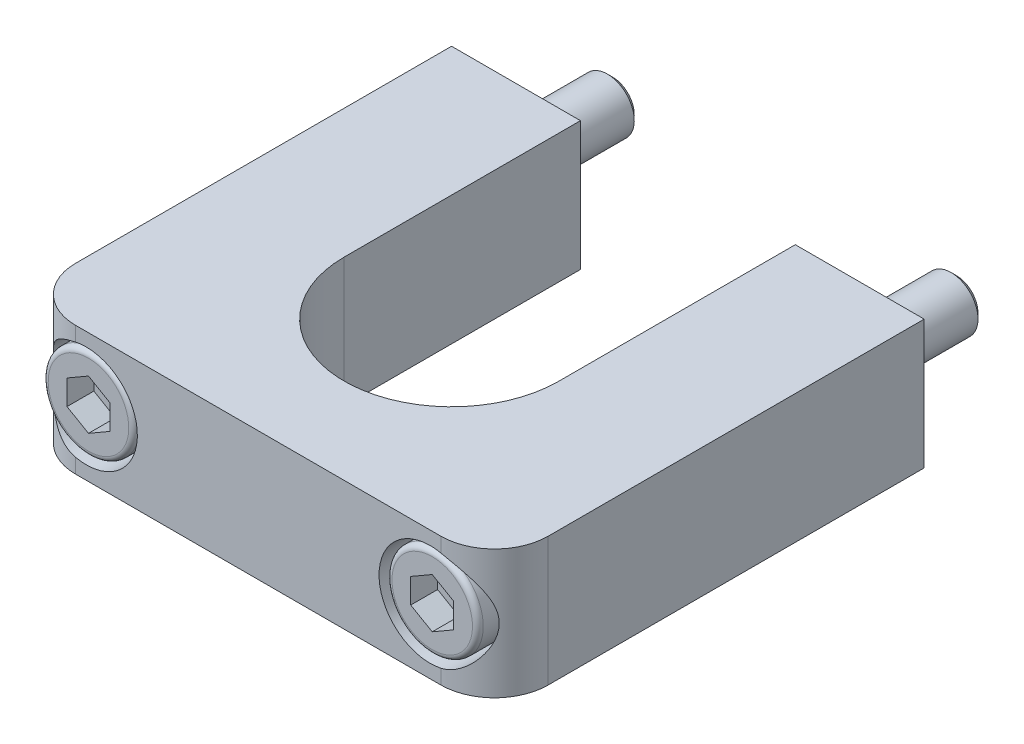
ISO-10303-21;
HEADER;
FILE_DESCRIPTION(('STEP AP214'),'2;1');
FILE_NAME('part.step','',(''),(''),'','','');
FILE_SCHEMA(('AUTOMOTIVE_DESIGN { 1 0 10303 214 1 1 1 1 }'));
ENDSEC;
DATA;
#1=APPLICATION_CONTEXT('core data for automotive mechanical design processes');
#2=APPLICATION_PROTOCOL_DEFINITION('international standard','automotive_design',2000,#1);
#3=PRODUCT_CONTEXT('',#1,'mechanical');
#4=PRODUCT('Part','Part','',(#3));
#5=PRODUCT_RELATED_PRODUCT_CATEGORY('part','',(#4));
#6=PRODUCT_DEFINITION_FORMATION('','',#4);
#7=PRODUCT_DEFINITION_CONTEXT('part definition',#1,'design');
#8=PRODUCT_DEFINITION('design','',#6,#7);
#9=PRODUCT_DEFINITION_SHAPE('','',#8);
#10=(LENGTH_UNIT() NAMED_UNIT(*) SI_UNIT(.MILLI.,.METRE.));
#11=(NAMED_UNIT(*) PLANE_ANGLE_UNIT() SI_UNIT($,.RADIAN.));
#12=(NAMED_UNIT(*) SI_UNIT($,.STERADIAN.) SOLID_ANGLE_UNIT());
#13=UNCERTAINTY_MEASURE_WITH_UNIT(LENGTH_MEASURE(1.E-05),#10,'distance_accuracy_value','');
#14=(GEOMETRIC_REPRESENTATION_CONTEXT(3) GLOBAL_UNCERTAINTY_ASSIGNED_CONTEXT((#13)) GLOBAL_UNIT_ASSIGNED_CONTEXT((#10,
#11,#12)) REPRESENTATION_CONTEXT('',''));
#15=CARTESIAN_POINT('',(0.,0.,0.));
#16=DIRECTION('',(0.,0.,1.));
#17=DIRECTION('',(1.,0.,0.));
#18=AXIS2_PLACEMENT_3D('',#15,#16,#17);
#19=CARTESIAN_POINT('',(32.,-1.38960957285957E-13,39.8));
#20=DIRECTION('',(0.,0.,-1.));
#21=DIRECTION('',(0.,1.,0.));
#22=AXIS2_PLACEMENT_3D('',#19,#20,#21);
#23=PLANE('',#22);
#24=CARTESIAN_POINT('',(32.,-1.38960957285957E-13,39.8));
#25=DIRECTION('',(0.,0.,-1.));
#26=DIRECTION('',(0.,1.,0.));
#27=AXIS2_PLACEMENT_3D('',#24,#25,#26);
#28=CIRCLE('',#27,3.75);
#29=CARTESIAN_POINT('',(32.,3.74999999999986,39.8));
#30=VERTEX_POINT('',#29);
#31=EDGE_CURVE('E256',#30,#30,#28,.T.);
#32=ORIENTED_EDGE('',*,*,#31,.F.);
#33=EDGE_LOOP('',(#32));
#34=FACE_BOUND('',#33,.T.);
#35=DIRECTION('',(0.,-1.,0.));
#36=VECTOR('',#35,1.);
#37=CARTESIAN_POINT('',(30.,-1.38960957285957E-13,39.8));
#38=LINE('',#37,#36);
#39=CARTESIAN_POINT('',(30.,1.15470053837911,39.8));
#40=VERTEX_POINT('',#39);
#41=CARTESIAN_POINT('',(30.,-1.15470053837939,39.8));
#42=VERTEX_POINT('',#41);
#43=EDGE_CURVE('E9',#40,#42,#38,.T.);
#44=ORIENTED_EDGE('',*,*,#43,.F.);
#45=DIRECTION('',(-0.866025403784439,-0.5,0.));
#46=VECTOR('',#45,1.);
#47=CARTESIAN_POINT('',(31.,1.73205080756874,39.8));
#48=LINE('',#47,#46);
#49=CARTESIAN_POINT('',(32.,2.30940107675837,39.8));
#50=VERTEX_POINT('',#49);
#51=EDGE_CURVE('E406',#50,#40,#48,.T.);
#52=ORIENTED_EDGE('',*,*,#51,.F.);
#53=DIRECTION('',(-0.866025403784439,0.5,0.));
#54=VECTOR('',#53,1.);
#55=CARTESIAN_POINT('',(33.,1.73205080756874,39.8));
#56=LINE('',#55,#54);
#57=CARTESIAN_POINT('',(34.,1.15470053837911,39.8));
#58=VERTEX_POINT('',#57);
#59=EDGE_CURVE('E408',#58,#50,#56,.T.);
#60=ORIENTED_EDGE('',*,*,#59,.F.);
#61=DIRECTION('',(0.,1.,0.));
#62=VECTOR('',#61,1.);
#63=CARTESIAN_POINT('',(34.,-1.38960957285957E-13,39.8));
#64=LINE('',#63,#62);
#65=CARTESIAN_POINT('',(34.,-1.15470053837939,39.8));
#66=VERTEX_POINT('',#65);
#67=EDGE_CURVE('E410',#66,#58,#64,.T.);
#68=ORIENTED_EDGE('',*,*,#67,.F.);
#69=DIRECTION('',(0.866025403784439,0.5,0.));
#70=VECTOR('',#69,1.);
#71=CARTESIAN_POINT('',(33.,-1.73205080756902,39.8));
#72=LINE('',#71,#70);
#73=CARTESIAN_POINT('',(32.,-2.30940107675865,39.8));
#74=VERTEX_POINT('',#73);
#75=EDGE_CURVE('E412',#74,#66,#72,.T.);
#76=ORIENTED_EDGE('',*,*,#75,.F.);
#77=DIRECTION('',(0.866025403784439,-0.5,0.));
#78=VECTOR('',#77,1.);
#79=CARTESIAN_POINT('',(31.,-1.73205080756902,39.8));
#80=LINE('',#79,#78);
#81=EDGE_CURVE('E23',#42,#74,#80,.T.);
#82=ORIENTED_EDGE('',*,*,#81,.F.);
#83=EDGE_LOOP('',(#44,#52,#60,#68,#76,#82));
#84=FACE_BOUND('',#83,.T.);
#85=ADVANCED_FACE('F14',(#34,#84),#23,.F.);
#86=CARTESIAN_POINT('',(0.,-1.38960957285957E-13,39.8));
#87=DIRECTION('',(0.,0.,-1.));
#88=DIRECTION('',(0.,1.,0.));
#89=AXIS2_PLACEMENT_3D('',#86,#87,#88);
#90=PLANE('',#89);
#91=CARTESIAN_POINT('',(0.,-1.38960957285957E-13,39.8));
#92=DIRECTION('',(0.,0.,-1.));
#93=DIRECTION('',(0.,1.,0.));
#94=AXIS2_PLACEMENT_3D('',#91,#92,#93);
#95=CIRCLE('',#94,3.75);
#96=CARTESIAN_POINT('',(0.,3.74999999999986,39.8));
#97=VERTEX_POINT('',#96);
#98=EDGE_CURVE('E265',#97,#97,#95,.T.);
#99=ORIENTED_EDGE('',*,*,#98,.F.);
#100=EDGE_LOOP('',(#99));
#101=FACE_BOUND('',#100,.T.);
#102=DIRECTION('',(0.,-1.,0.));
#103=VECTOR('',#102,1.);
#104=CARTESIAN_POINT('',(-2.,-1.38960957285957E-13,39.8));
#105=LINE('',#104,#103);
#106=CARTESIAN_POINT('',(-2.,1.15470053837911,39.8));
#107=VERTEX_POINT('',#106);
#108=CARTESIAN_POINT('',(-2.,-1.15470053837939,39.8));
#109=VERTEX_POINT('',#108);
#110=EDGE_CURVE('E404',#107,#109,#105,.T.);
#111=ORIENTED_EDGE('',*,*,#110,.F.);
#112=DIRECTION('',(-0.866025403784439,-0.5,0.));
#113=VECTOR('',#112,1.);
#114=CARTESIAN_POINT('',(-1.,1.73205080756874,39.8));
#115=LINE('',#114,#113);
#116=CARTESIAN_POINT('',(0.,2.30940107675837,39.8));
#117=VERTEX_POINT('',#116);
#118=EDGE_CURVE('E393',#117,#107,#115,.T.);
#119=ORIENTED_EDGE('',*,*,#118,.F.);
#120=DIRECTION('',(-0.866025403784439,0.5,0.));
#121=VECTOR('',#120,1.);
#122=CARTESIAN_POINT('',(1.,1.73205080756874,39.8));
#123=LINE('',#122,#121);
#124=CARTESIAN_POINT('',(2.,1.15470053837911,39.8));
#125=VERTEX_POINT('',#124);
#126=EDGE_CURVE('E395',#125,#117,#123,.T.);
#127=ORIENTED_EDGE('',*,*,#126,.F.);
#128=DIRECTION('',(0.,1.,0.));
#129=VECTOR('',#128,1.);
#130=CARTESIAN_POINT('',(2.,-1.38960957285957E-13,39.8));
#131=LINE('',#130,#129);
#132=CARTESIAN_POINT('',(2.,-1.15470053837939,39.8));
#133=VERTEX_POINT('',#132);
#134=EDGE_CURVE('E397',#133,#125,#131,.T.);
#135=ORIENTED_EDGE('',*,*,#134,.F.);
#136=DIRECTION('',(0.866025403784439,0.5,0.));
#137=VECTOR('',#136,1.);
#138=CARTESIAN_POINT('',(1.,-1.73205080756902,39.8));
#139=LINE('',#138,#137);
#140=CARTESIAN_POINT('',(0.,-2.30940107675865,39.8));
#141=VERTEX_POINT('',#140);
#142=EDGE_CURVE('E399',#141,#133,#139,.T.);
#143=ORIENTED_EDGE('',*,*,#142,.F.);
#144=DIRECTION('',(0.866025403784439,-0.5,0.));
#145=VECTOR('',#144,1.);
#146=CARTESIAN_POINT('',(-1.,-1.73205080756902,39.8));
#147=LINE('',#146,#145);
#148=EDGE_CURVE('E402',#109,#141,#147,.T.);
#149=ORIENTED_EDGE('',*,*,#148,.F.);
#150=EDGE_LOOP('',(#111,#119,#127,#135,#143,#149));
#151=FACE_BOUND('',#150,.T.);
#152=ADVANCED_FACE('F494',(#101,#151),#90,.F.);
#153=CARTESIAN_POINT('',(33.,-6.00000000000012,35.));
#154=DIRECTION('',(0.,1.,0.));
#155=DIRECTION('',(-1.,0.,0.));
#156=AXIS2_PLACEMENT_3D('',#153,#154,#155);
#157=CYLINDRICAL_SURFACE('',#156,5.);
#158=CARTESIAN_POINT('',(33.,-4.64354390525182,40.));
#159=CARTESIAN_POINT('',(33.113577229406,-4.61911352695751,40.000026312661));
#160=CARTESIAN_POINT('',(33.2261989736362,-4.5904727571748,39.996131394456));
#161=CARTESIAN_POINT('',(33.4484801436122,-4.52523301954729,39.9810830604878));
#162=CARTESIAN_POINT('',(33.5581428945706,-4.4886434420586,39.9699381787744));
#163=CARTESIAN_POINT('',(33.7727785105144,-4.40826406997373,39.9410985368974));
#164=CARTESIAN_POINT('',(33.8777841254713,-4.36454038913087,39.9234622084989));
#165=CARTESIAN_POINT('',(34.0834508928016,-4.27019279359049,39.8823298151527));
#166=CARTESIAN_POINT('',(34.1841109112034,-4.21956709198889,39.8588322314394));
#167=CARTESIAN_POINT('',(34.4778166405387,-4.05863601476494,39.7808868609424));
#168=CARTESIAN_POINT('',(34.6637550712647,-3.93883272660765,39.7188155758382));
#169=CARTESIAN_POINT('',(35.0141615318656,-3.67767986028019,39.5802666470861));
#170=CARTESIAN_POINT('',(35.1785767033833,-3.5362790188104,39.5037546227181));
#171=CARTESIAN_POINT('',(35.5055631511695,-3.21450833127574,39.3313669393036));
#172=CARTESIAN_POINT('',(35.6648440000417,-3.03145406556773,39.2342729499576));
#173=CARTESIAN_POINT('',(35.9535549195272,-2.6439312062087,39.0381869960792));
#174=CARTESIAN_POINT('',(36.0829676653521,-2.43945028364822,38.9391939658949));
#175=CARTESIAN_POINT('',(36.3004062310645,-2.02927596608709,38.7583847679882));
#176=CARTESIAN_POINT('',(36.391102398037,-1.82533494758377,38.6758243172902));
#177=CARTESIAN_POINT('',(36.5442204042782,-1.40111936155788,38.528431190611));
#178=CARTESIAN_POINT('',(36.606705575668,-1.1808826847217,38.4635589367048));
#179=CARTESIAN_POINT('',(36.6893902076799,-0.777505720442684,38.3750946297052));
#180=CARTESIAN_POINT('',(36.7159053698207,-0.597016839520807,38.3455288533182));
#181=CARTESIAN_POINT('',(36.7478525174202,-0.232010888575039,38.3097185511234));
#182=CARTESIAN_POINT('',(36.7533170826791,-0.0475004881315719,38.3034379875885));
#183=CARTESIAN_POINT('',(36.7427725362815,0.320047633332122,38.3153716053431));
#184=CARTESIAN_POINT('',(36.7267645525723,0.503085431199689,38.3335844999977));
#185=CARTESIAN_POINT('',(36.6745073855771,0.862962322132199,38.3910845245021));
#186=CARTESIAN_POINT('',(36.6382176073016,1.03978822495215,38.4304139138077));
#187=CARTESIAN_POINT('',(36.5280009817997,1.4574449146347,38.544254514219));
#188=CARTESIAN_POINT('',(36.4446409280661,1.69363572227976,38.626612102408));
#189=CARTESIAN_POINT('',(36.295087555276,2.03224760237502,38.7612447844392));
#190=CARTESIAN_POINT('',(36.2410521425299,2.14265838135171,38.8080496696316));
#191=CARTESIAN_POINT('',(36.1250506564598,2.35826640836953,38.9038071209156));
#192=CARTESIAN_POINT('',(36.0630855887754,2.46346431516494,38.9527594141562));
#193=CARTESIAN_POINT('',(35.8607080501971,2.77873907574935,39.1043117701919));
#194=CARTESIAN_POINT('',(35.7074779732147,2.98020199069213,39.2081022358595));
#195=CARTESIAN_POINT('',(35.3688464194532,3.35822314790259,39.4076351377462));
#196=CARTESIAN_POINT('',(35.1834791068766,3.53480748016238,39.5033859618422));
#197=CARTESIAN_POINT('',(34.8096663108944,3.83632408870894,39.6648073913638));
#198=CARTESIAN_POINT('',(34.6253318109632,3.96502834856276,39.7328152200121));
#199=CARTESIAN_POINT('',(34.3334066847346,4.13890556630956,39.8199942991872));
#200=CARTESIAN_POINT('',(34.2336119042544,4.19363274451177,39.8465668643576));
#201=CARTESIAN_POINT('',(34.0292831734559,4.29622741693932,39.8940340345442));
#202=CARTESIAN_POINT('',(33.9247508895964,4.34409729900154,39.9149306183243));
#203=CARTESIAN_POINT('',(33.6871516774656,4.44253129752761,39.9543331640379));
#204=CARTESIAN_POINT('',(33.5530154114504,4.49121867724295,39.9712061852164));
#205=CARTESIAN_POINT('',(33.3481874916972,4.5552211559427,39.9883353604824));
#206=CARTESIAN_POINT('',(33.2792063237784,4.57507245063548,39.9926820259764));
#207=CARTESIAN_POINT('',(33.1402725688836,4.6116637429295,39.9985159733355));
#208=CARTESIAN_POINT('',(33.0703195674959,4.62840236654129,40.0000019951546));
#209=CARTESIAN_POINT('',(33.,4.64354390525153,40.));
#210=B_SPLINE_CURVE_WITH_KNOTS('',3,(#158,#159,#160,#161,#162,#163,#164,#165,#166,#167,#168,
#169,#170,#171,#172,#173,#174,#175,#176,#177,#178,#179,#180,#181,#182,#183,#184,#185,#186,#187,
#188,#189,#190,#191,#192,#193,#194,#195,#196,#197,#198,#199,#200,#201,#202,#203,#204,#205,#206,
#207,#208,#209),.UNSPECIFIED.,.F.,.F.,(4,2,2,2,2,2,2,2,2,2,2,2,2,2,2,2,2,2,2,2,2,2,2,2,2,4),(0.,
0.348307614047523,0.69620596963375,1.04104644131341,1.38597636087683,2.07210353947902,
2.75988535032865,3.54118531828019,4.32293734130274,5.03460033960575,5.74465765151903,
6.29670085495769,6.84788932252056,7.39904883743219,7.95131549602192,8.73767249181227,
9.13202620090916,9.52632994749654,10.3438248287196,11.1604559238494,11.8620649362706,
12.2123213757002,12.5624555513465,12.9924670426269,13.2080905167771,13.4238089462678),.UNSPECIFIED.);
#211=CARTESIAN_POINT('',(33.,-4.64354390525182,40.));
#212=VERTEX_POINT('',#211);
#213=CARTESIAN_POINT('',(33.,4.64354390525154,40.));
#214=VERTEX_POINT('',#213);
#215=EDGE_CURVE('E271',#212,#214,#210,.T.);
#216=ORIENTED_EDGE('',*,*,#215,.F.);
#217=DIRECTION('',(0.,1.,0.));
#218=VECTOR('',#217,1.);
#219=CARTESIAN_POINT('',(33.,-6.00000000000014,40.));
#220=LINE('',#219,#218);
#221=CARTESIAN_POINT('',(33.,-6.00000000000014,40.));
#222=VERTEX_POINT('',#221);
#223=EDGE_CURVE('E363',#222,#212,#220,.T.);
#224=ORIENTED_EDGE('',*,*,#223,.F.);
#225=CARTESIAN_POINT('',(33.,-6.00000000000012,35.));
#226=DIRECTION('',(0.,-1.,0.));
#227=DIRECTION('',(1.,0.,0.));
#228=AXIS2_PLACEMENT_3D('',#225,#226,#227);
#229=CIRCLE('',#228,5.);
#230=CARTESIAN_POINT('',(38.,-6.00000000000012,35.));
#231=VERTEX_POINT('',#230);
#232=EDGE_CURVE('E332',#231,#222,#229,.T.);
#233=ORIENTED_EDGE('',*,*,#232,.F.);
#234=DIRECTION('',(0.,1.,0.));
#235=VECTOR('',#234,1.);
#236=CARTESIAN_POINT('',(38.,-6.00000000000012,35.));
#237=LINE('',#236,#235);
#238=CARTESIAN_POINT('',(38.,5.99999999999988,35.));
#239=VERTEX_POINT('',#238);
#240=EDGE_CURVE('E366',#231,#239,#237,.T.);
#241=ORIENTED_EDGE('',*,*,#240,.T.);
#242=CARTESIAN_POINT('',(33.,5.99999999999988,35.));
#243=DIRECTION('',(0.,-1.,0.));
#244=DIRECTION('',(1.,0.,0.));
#245=AXIS2_PLACEMENT_3D('',#242,#243,#244);
#246=CIRCLE('',#245,5.);
#247=CARTESIAN_POINT('',(33.,5.99999999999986,40.));
#248=VERTEX_POINT('',#247);
#249=EDGE_CURVE('E354',#239,#248,#246,.T.);
#250=ORIENTED_EDGE('',*,*,#249,.T.);
#251=EDGE_CURVE('E362',#214,#248,#220,.T.);
#252=ORIENTED_EDGE('',*,*,#251,.F.);
#253=EDGE_LOOP('',(#216,#224,#233,#241,#250,#252));
#254=FACE_BOUND('',#253,.T.);
#255=ADVANCED_FACE('F281',(#254),#157,.T.);
#256=CARTESIAN_POINT('',(-1.,-6.00000000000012,35.));
#257=DIRECTION('',(0.,1.,0.));
#258=DIRECTION('',(-1.,0.,0.));
#259=AXIS2_PLACEMENT_3D('',#256,#257,#258);
#260=CYLINDRICAL_SURFACE('',#259,5.);
#261=CARTESIAN_POINT('',(-1.,4.64354390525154,40.));
#262=CARTESIAN_POINT('',(-1.11357722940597,4.61911352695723,40.000026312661));
#263=CARTESIAN_POINT('',(-1.22619897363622,4.59047275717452,39.9961313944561));
#264=CARTESIAN_POINT('',(-1.44848014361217,4.52523301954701,39.9810830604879));
#265=CARTESIAN_POINT('',(-1.55814289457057,4.48864344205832,39.9699381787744));
#266=CARTESIAN_POINT('',(-1.77277851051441,4.40826406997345,39.9410985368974));
#267=CARTESIAN_POINT('',(-1.87778412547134,4.36454038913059,39.9234622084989));
#268=CARTESIAN_POINT('',(-2.08345089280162,4.27019279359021,39.8823298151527));
#269=CARTESIAN_POINT('',(-2.18411091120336,4.21956709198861,39.8588322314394));
#270=CARTESIAN_POINT('',(-2.47781664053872,4.05863601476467,39.7808868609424));
#271=CARTESIAN_POINT('',(-2.66375507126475,3.93883272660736,39.7188155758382));
#272=CARTESIAN_POINT('',(-3.01416153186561,3.67767986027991,39.5802666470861));
#273=CARTESIAN_POINT('',(-3.17857670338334,3.53627901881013,39.5037546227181));
#274=CARTESIAN_POINT('',(-3.50556315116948,3.21450833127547,39.3313669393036));
#275=CARTESIAN_POINT('',(-3.66484400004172,3.03145406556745,39.2342729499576));
#276=CARTESIAN_POINT('',(-3.9535549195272,2.64393120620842,39.0381869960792));
#277=CARTESIAN_POINT('',(-4.08296766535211,2.43945028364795,38.9391939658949));
#278=CARTESIAN_POINT('',(-4.30040623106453,2.02927596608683,38.7583847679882));
#279=CARTESIAN_POINT('',(-4.39110239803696,1.82533494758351,38.6758243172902));
#280=CARTESIAN_POINT('',(-4.54422040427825,1.40111936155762,38.528431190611));
#281=CARTESIAN_POINT('',(-4.60670557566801,1.18088268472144,38.4635589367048));
#282=CARTESIAN_POINT('',(-4.68939020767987,0.777505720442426,38.3750946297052));
#283=CARTESIAN_POINT('',(-4.71590536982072,0.597016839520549,38.3455288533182));
#284=CARTESIAN_POINT('',(-4.74785251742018,0.23201088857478,38.3097185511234));
#285=CARTESIAN_POINT('',(-4.75331708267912,0.0475004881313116,38.3034379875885));
#286=CARTESIAN_POINT('',(-4.74277253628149,-0.320047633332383,38.3153716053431));
#287=CARTESIAN_POINT('',(-4.72676455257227,-0.503085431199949,38.3335844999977));
#288=CARTESIAN_POINT('',(-4.67450738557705,-0.862962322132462,38.3910845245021));
#289=CARTESIAN_POINT('',(-4.63821760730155,-1.03978822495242,38.4304139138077));
#290=CARTESIAN_POINT('',(-4.52800098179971,-1.45744491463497,38.5442545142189));
#291=CARTESIAN_POINT('',(-4.44464092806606,-1.69363572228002,38.626612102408));
#292=CARTESIAN_POINT('',(-4.29508755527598,-2.03224760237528,38.7612447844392));
#293=CARTESIAN_POINT('',(-4.24105214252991,-2.14265838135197,38.8080496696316));
#294=CARTESIAN_POINT('',(-4.1250506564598,-2.3582664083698,38.9038071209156));
#295=CARTESIAN_POINT('',(-4.06308558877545,-2.46346431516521,38.9527594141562));
#296=CARTESIAN_POINT('',(-3.86070805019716,-2.77873907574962,39.1043117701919));
#297=CARTESIAN_POINT('',(-3.7074779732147,-2.9802019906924,39.2081022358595));
#298=CARTESIAN_POINT('',(-3.36884641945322,-3.35822314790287,39.4076351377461));
#299=CARTESIAN_POINT('',(-3.18347910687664,-3.53480748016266,39.5033859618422));
#300=CARTESIAN_POINT('',(-2.80966631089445,-3.83632408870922,39.6648073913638));
#301=CARTESIAN_POINT('',(-2.62533181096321,-3.96502834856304,39.7328152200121));
#302=CARTESIAN_POINT('',(-2.33340668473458,-4.13890556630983,39.8199942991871));
#303=CARTESIAN_POINT('',(-2.23361190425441,-4.19363274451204,39.8465668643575));
#304=CARTESIAN_POINT('',(-2.02928317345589,-4.29622741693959,39.8940340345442));
#305=CARTESIAN_POINT('',(-1.92475088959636,-4.34409729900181,39.9149306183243));
#306=CARTESIAN_POINT('',(-1.68715167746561,-4.44253129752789,39.9543331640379));
#307=CARTESIAN_POINT('',(-1.55301541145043,-4.49121867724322,39.9712061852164));
#308=CARTESIAN_POINT('',(-1.34818749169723,-4.55522115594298,39.9883353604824));
#309=CARTESIAN_POINT('',(-1.27920632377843,-4.57507245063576,39.9926820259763));
#310=CARTESIAN_POINT('',(-1.14027256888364,-4.61166374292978,39.9985159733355));
#311=CARTESIAN_POINT('',(-1.07031956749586,-4.62840236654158,40.0000019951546));
#312=CARTESIAN_POINT('',(-1.,-4.64354390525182,40.));
#313=B_SPLINE_CURVE_WITH_KNOTS('',3,(#261,#262,#263,#264,#265,#266,#267,#268,#269,#270,#271,
#272,#273,#274,#275,#276,#277,#278,#279,#280,#281,#282,#283,#284,#285,#286,#287,#288,#289,#290,
#291,#292,#293,#294,#295,#296,#297,#298,#299,#300,#301,#302,#303,#304,#305,#306,#307,#308,#309,
#310,#311,#312),.UNSPECIFIED.,.F.,.F.,(4,2,2,2,2,2,2,2,2,2,2,2,2,2,2,2,2,2,2,2,2,2,2,2,2,4),(0.,
0.348307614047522,0.696205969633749,1.04104644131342,1.38597636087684,2.07210353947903,
2.75988535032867,3.5411853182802,4.32293734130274,5.03460033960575,5.74465765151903,
6.29670085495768,6.84788932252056,7.39904883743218,7.95131549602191,8.73767249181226,
9.13202620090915,9.52632994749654,10.3438248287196,11.1604559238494,11.8620649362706,
12.2123213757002,12.5624555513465,12.992467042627,13.2080905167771,13.4238089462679),.UNSPECIFIED.);
#314=CARTESIAN_POINT('',(-1.,4.64354390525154,40.));
#315=VERTEX_POINT('',#314);
#316=CARTESIAN_POINT('',(-1.,-4.64354390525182,40.));
#317=VERTEX_POINT('',#316);
#318=EDGE_CURVE('E305',#315,#317,#313,.T.);
#319=ORIENTED_EDGE('',*,*,#318,.F.);
#320=DIRECTION('',(0.,1.,0.));
#321=VECTOR('',#320,1.);
#322=CARTESIAN_POINT('',(-1.,-6.00000000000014,40.));
#323=LINE('',#322,#321);
#324=CARTESIAN_POINT('',(-1.,5.99999999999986,40.));
#325=VERTEX_POINT('',#324);
#326=EDGE_CURVE('E336',#315,#325,#323,.T.);
#327=ORIENTED_EDGE('',*,*,#326,.T.);
#328=CARTESIAN_POINT('',(-1.,5.99999999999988,35.));
#329=DIRECTION('',(0.,-1.,0.));
#330=DIRECTION('',(1.,0.,0.));
#331=AXIS2_PLACEMENT_3D('',#328,#329,#330);
#332=CIRCLE('',#331,5.);
#333=CARTESIAN_POINT('',(-6.,5.99999999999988,35.));
#334=VERTEX_POINT('',#333);
#335=EDGE_CURVE('E312',#325,#334,#332,.T.);
#336=ORIENTED_EDGE('',*,*,#335,.T.);
#337=DIRECTION('',(0.,1.,0.));
#338=VECTOR('',#337,1.);
#339=CARTESIAN_POINT('',(-6.,-6.00000000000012,35.));
#340=LINE('',#339,#338);
#341=CARTESIAN_POINT('',(-6.,-6.00000000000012,35.));
#342=VERTEX_POINT('',#341);
#343=EDGE_CURVE('E386',#342,#334,#340,.T.);
#344=ORIENTED_EDGE('',*,*,#343,.F.);
#345=CARTESIAN_POINT('',(-1.,-6.00000000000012,35.));
#346=DIRECTION('',(0.,-1.,0.));
#347=DIRECTION('',(1.,0.,0.));
#348=AXIS2_PLACEMENT_3D('',#345,#346,#347);
#349=CIRCLE('',#348,5.);
#350=CARTESIAN_POINT('',(-1.,-6.00000000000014,40.));
#351=VERTEX_POINT('',#350);
#352=EDGE_CURVE('E313',#351,#342,#349,.T.);
#353=ORIENTED_EDGE('',*,*,#352,.F.);
#354=EDGE_CURVE('E359',#351,#317,#323,.T.);
#355=ORIENTED_EDGE('',*,*,#354,.T.);
#356=EDGE_LOOP('',(#319,#327,#336,#344,#353,#355));
#357=FACE_BOUND('',#356,.T.);
#358=ADVANCED_FACE('F16',(#357),#260,.T.);
#359=CARTESIAN_POINT('',(-6.,-6.00000000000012,35.));
#360=DIRECTION('',(1.,0.,0.));
#361=DIRECTION('',(0.,1.,0.));
#362=AXIS2_PLACEMENT_3D('',#359,#360,#361);
#363=PLANE('',#362);
#364=DIRECTION('',(0.,0.,-1.));
#365=VECTOR('',#364,1.);
#366=CARTESIAN_POINT('',(-6.,5.99999999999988,35.));
#367=LINE('',#366,#365);
#368=CARTESIAN_POINT('',(-6.,6.,0.));
#369=VERTEX_POINT('',#368);
#370=EDGE_CURVE('E339',#334,#369,#367,.T.);
#371=ORIENTED_EDGE('',*,*,#370,.T.);
#372=DIRECTION('',(0.,1.,0.));
#373=VECTOR('',#372,1.);
#374=CARTESIAN_POINT('',(-6.,-6.,0.));
#375=LINE('',#374,#373);
#376=CARTESIAN_POINT('',(-6.,-6.,0.));
#377=VERTEX_POINT('',#376);
#378=EDGE_CURVE('E383',#377,#369,#375,.T.);
#379=ORIENTED_EDGE('',*,*,#378,.F.);
#380=DIRECTION('',(0.,0.,-1.));
#381=VECTOR('',#380,1.);
#382=CARTESIAN_POINT('',(-6.,-6.00000000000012,35.));
#383=LINE('',#382,#381);
#384=EDGE_CURVE('E316',#342,#377,#383,.T.);
#385=ORIENTED_EDGE('',*,*,#384,.F.);
#386=ORIENTED_EDGE('',*,*,#343,.T.);
#387=EDGE_LOOP('',(#371,#379,#385,#386));
#388=FACE_BOUND('',#387,.T.);
#389=ADVANCED_FACE('F538',(#388),#363,.F.);
#390=CARTESIAN_POINT('',(-6.,-6.,0.));
#391=DIRECTION('',(0.,0.,1.));
#392=DIRECTION('',(0.,-1.,0.));
#393=AXIS2_PLACEMENT_3D('',#390,#391,#392);
#394=PLANE('',#393);
#395=DIRECTION('',(1.,0.,0.));
#396=VECTOR('',#395,1.);
#397=CARTESIAN_POINT('',(-6.,6.,0.));
#398=LINE('',#397,#396);
#399=CARTESIAN_POINT('',(6.,6.,0.));
#400=VERTEX_POINT('',#399);
#401=EDGE_CURVE('E341',#369,#400,#398,.T.);
#402=ORIENTED_EDGE('',*,*,#401,.T.);
#403=DIRECTION('',(0.,1.,0.));
#404=VECTOR('',#403,1.);
#405=CARTESIAN_POINT('',(6.,-6.,0.));
#406=LINE('',#405,#404);
#407=CARTESIAN_POINT('',(6.,-6.,0.));
#408=VERTEX_POINT('',#407);
#409=EDGE_CURVE('E380',#408,#400,#406,.T.);
#410=ORIENTED_EDGE('',*,*,#409,.F.);
#411=DIRECTION('',(1.,0.,0.));
#412=VECTOR('',#411,1.);
#413=CARTESIAN_POINT('',(-6.,-6.,0.));
#414=LINE('',#413,#412);
#415=EDGE_CURVE('E319',#377,#408,#414,.T.);
#416=ORIENTED_EDGE('',*,*,#415,.F.);
#417=ORIENTED_EDGE('',*,*,#378,.T.);
#418=EDGE_LOOP('',(#402,#410,#416,#417));
#419=FACE_BOUND('',#418,.T.);
#420=CARTESIAN_POINT('',(0.,0.,0.));
#421=DIRECTION('',(0.,0.,-1.));
#422=DIRECTION('',(0.,1.,0.));
#423=AXIS2_PLACEMENT_3D('',#420,#421,#422);
#424=CIRCLE('',#423,2.5);
#425=CARTESIAN_POINT('',(0.,2.5,0.));
#426=VERTEX_POINT('',#425);
#427=EDGE_CURVE('E878',#426,#426,#424,.T.);
#428=ORIENTED_EDGE('',*,*,#427,.F.);
#429=EDGE_LOOP('',(#428));
#430=FACE_BOUND('',#429,.T.);
#431=ADVANCED_FACE('F572',(#419,#430),#394,.F.);
#432=CARTESIAN_POINT('',(6.,-6.,0.));
#433=DIRECTION('',(-1.,0.,0.));
#434=DIRECTION('',(0.,-1.,0.));
#435=AXIS2_PLACEMENT_3D('',#432,#433,#434);
#436=PLANE('',#435);
#437=DIRECTION('',(0.,0.,1.));
#438=VECTOR('',#437,1.);
#439=CARTESIAN_POINT('',(6.,6.,0.));
#440=LINE('',#439,#438);
#441=CARTESIAN_POINT('',(6.,5.99999999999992,22.));
#442=VERTEX_POINT('',#441);
#443=EDGE_CURVE('E343',#400,#442,#440,.T.);
#444=ORIENTED_EDGE('',*,*,#443,.T.);
#445=DIRECTION('',(0.,1.,0.));
#446=VECTOR('',#445,1.);
#447=CARTESIAN_POINT('',(6.,-6.00000000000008,22.));
#448=LINE('',#447,#446);
#449=CARTESIAN_POINT('',(6.,-6.00000000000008,22.));
#450=VERTEX_POINT('',#449);
#451=EDGE_CURVE('E377',#450,#442,#448,.T.);
#452=ORIENTED_EDGE('',*,*,#451,.F.);
#453=DIRECTION('',(0.,0.,1.));
#454=VECTOR('',#453,1.);
#455=CARTESIAN_POINT('',(6.,-6.,0.));
#456=LINE('',#455,#454);
#457=EDGE_CURVE('E321',#408,#450,#456,.T.);
#458=ORIENTED_EDGE('',*,*,#457,.F.);
#459=ORIENTED_EDGE('',*,*,#409,.T.);
#460=EDGE_LOOP('',(#444,#452,#458,#459));
#461=FACE_BOUND('',#460,.T.);
#462=ADVANCED_FACE('F577',(#461),#436,.F.);
#463=CARTESIAN_POINT('',(16.,-6.00000000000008,22.));
#464=DIRECTION('',(0.,1.,0.));
#465=DIRECTION('',(-1.,0.,0.));
#466=AXIS2_PLACEMENT_3D('',#463,#464,#465);
#467=CYLINDRICAL_SURFACE('',#466,10.);
#468=CARTESIAN_POINT('',(16.,5.99999999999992,22.));
#469=DIRECTION('',(0.,-1.,0.));
#470=DIRECTION('',(1.,0.,0.));
#471=AXIS2_PLACEMENT_3D('',#468,#469,#470);
#472=CIRCLE('',#471,10.);
#473=CARTESIAN_POINT('',(26.,5.99999999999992,22.));
#474=VERTEX_POINT('',#473);
#475=EDGE_CURVE('E346',#474,#442,#472,.T.);
#476=ORIENTED_EDGE('',*,*,#475,.F.);
#477=DIRECTION('',(0.,1.,0.));
#478=VECTOR('',#477,1.);
#479=CARTESIAN_POINT('',(26.,-6.00000000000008,22.));
#480=LINE('',#479,#478);
#481=CARTESIAN_POINT('',(26.,-6.00000000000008,22.));
#482=VERTEX_POINT('',#481);
#483=EDGE_CURVE('E375',#482,#474,#480,.T.);
#484=ORIENTED_EDGE('',*,*,#483,.F.);
#485=CARTESIAN_POINT('',(16.,-6.00000000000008,22.));
#486=DIRECTION('',(0.,-1.,0.));
#487=DIRECTION('',(1.,0.,0.));
#488=AXIS2_PLACEMENT_3D('',#485,#486,#487);
#489=CIRCLE('',#488,10.);
#490=EDGE_CURVE('E323',#482,#450,#489,.T.);
#491=ORIENTED_EDGE('',*,*,#490,.T.);
#492=ORIENTED_EDGE('',*,*,#451,.T.);
#493=EDGE_LOOP('',(#476,#484,#491,#492));
#494=FACE_BOUND('',#493,.T.);
#495=ADVANCED_FACE('F581',(#494),#467,.F.);
#496=CARTESIAN_POINT('',(26.,-6.00000000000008,22.));
#497=DIRECTION('',(1.,0.,0.));
#498=DIRECTION('',(0.,1.,0.));
#499=AXIS2_PLACEMENT_3D('',#496,#497,#498);
#500=PLANE('',#499);
#501=DIRECTION('',(0.,0.,-1.));
#502=VECTOR('',#501,1.);
#503=CARTESIAN_POINT('',(26.,5.99999999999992,22.));
#504=LINE('',#503,#502);
#505=CARTESIAN_POINT('',(26.,6.,0.));
#506=VERTEX_POINT('',#505);
#507=EDGE_CURVE('E348',#474,#506,#504,.T.);
#508=ORIENTED_EDGE('',*,*,#507,.T.);
#509=DIRECTION('',(0.,1.,0.));
#510=VECTOR('',#509,1.);
#511=CARTESIAN_POINT('',(26.,-6.,0.));
#512=LINE('',#511,#510);
#513=CARTESIAN_POINT('',(26.,-6.,0.));
#514=VERTEX_POINT('',#513);
#515=EDGE_CURVE('E372',#514,#506,#512,.T.);
#516=ORIENTED_EDGE('',*,*,#515,.F.);
#517=DIRECTION('',(0.,0.,-1.));
#518=VECTOR('',#517,1.);
#519=CARTESIAN_POINT('',(26.,-6.00000000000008,22.));
#520=LINE('',#519,#518);
#521=EDGE_CURVE('E326',#482,#514,#520,.T.);
#522=ORIENTED_EDGE('',*,*,#521,.F.);
#523=ORIENTED_EDGE('',*,*,#483,.T.);
#524=EDGE_LOOP('',(#508,#516,#522,#523));
#525=FACE_BOUND('',#524,.T.);
#526=ADVANCED_FACE('F587',(#525),#500,.F.);
#527=CARTESIAN_POINT('',(26.,-6.,0.));
#528=DIRECTION('',(0.,0.,1.));
#529=DIRECTION('',(0.,-1.,0.));
#530=AXIS2_PLACEMENT_3D('',#527,#528,#529);
#531=PLANE('',#530);
#532=DIRECTION('',(1.,0.,0.));
#533=VECTOR('',#532,1.);
#534=CARTESIAN_POINT('',(26.,6.,0.));
#535=LINE('',#534,#533);
#536=CARTESIAN_POINT('',(38.,6.,0.));
#537=VERTEX_POINT('',#536);
#538=EDGE_CURVE('E350',#506,#537,#535,.T.);
#539=ORIENTED_EDGE('',*,*,#538,.T.);
#540=DIRECTION('',(0.,1.,0.));
#541=VECTOR('',#540,1.);
#542=CARTESIAN_POINT('',(38.,-6.,0.));
#543=LINE('',#542,#541);
#544=CARTESIAN_POINT('',(38.,-6.,0.));
#545=VERTEX_POINT('',#544);
#546=EDGE_CURVE('E369',#545,#537,#543,.T.);
#547=ORIENTED_EDGE('',*,*,#546,.F.);
#548=DIRECTION('',(1.,0.,0.));
#549=VECTOR('',#548,1.);
#550=CARTESIAN_POINT('',(26.,-6.,0.));
#551=LINE('',#550,#549);
#552=EDGE_CURVE('E328',#514,#545,#551,.T.);
#553=ORIENTED_EDGE('',*,*,#552,.F.);
#554=ORIENTED_EDGE('',*,*,#515,.T.);
#555=EDGE_LOOP('',(#539,#547,#553,#554));
#556=FACE_BOUND('',#555,.T.);
#557=CARTESIAN_POINT('',(32.,0.,0.));
#558=DIRECTION('',(0.,0.,-1.));
#559=DIRECTION('',(0.,1.,0.));
#560=AXIS2_PLACEMENT_3D('',#557,#558,#559);
#561=CIRCLE('',#560,2.5);
#562=CARTESIAN_POINT('',(32.,2.5,0.));
#563=VERTEX_POINT('',#562);
#564=EDGE_CURVE('E874',#563,#563,#561,.T.);
#565=ORIENTED_EDGE('',*,*,#564,.F.);
#566=EDGE_LOOP('',(#565));
#567=FACE_BOUND('',#566,.T.);
#568=ADVANCED_FACE('F590',(#556,#567),#531,.F.);
#569=CARTESIAN_POINT('',(38.,-6.,0.));
#570=DIRECTION('',(-1.,0.,0.));
#571=DIRECTION('',(0.,-1.,0.));
#572=AXIS2_PLACEMENT_3D('',#569,#570,#571);
#573=PLANE('',#572);
#574=DIRECTION('',(0.,0.,1.));
#575=VECTOR('',#574,1.);
#576=CARTESIAN_POINT('',(38.,6.,0.));
#577=LINE('',#576,#575);
#578=EDGE_CURVE('E352',#537,#239,#577,.T.);
#579=ORIENTED_EDGE('',*,*,#578,.T.);
#580=ORIENTED_EDGE('',*,*,#240,.F.);
#581=DIRECTION('',(0.,0.,1.));
#582=VECTOR('',#581,1.);
#583=CARTESIAN_POINT('',(38.,-6.,0.));
#584=LINE('',#583,#582);
#585=EDGE_CURVE('E330',#545,#231,#584,.T.);
#586=ORIENTED_EDGE('',*,*,#585,.F.);
#587=ORIENTED_EDGE('',*,*,#546,.T.);
#588=EDGE_LOOP('',(#579,#580,#586,#587));
#589=FACE_BOUND('',#588,.T.);
#590=ADVANCED_FACE('F592',(#589),#573,.F.);
#591=CARTESIAN_POINT('',(33.,-6.00000000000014,40.));
#592=DIRECTION('',(0.,0.,-1.));
#593=DIRECTION('',(0.,1.,0.));
#594=AXIS2_PLACEMENT_3D('',#591,#592,#593);
#595=PLANE('',#594);
#596=CARTESIAN_POINT('',(32.,-1.39659253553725E-13,40.));
#597=DIRECTION('',(0.,0.,-1.));
#598=DIRECTION('',(0.,1.,0.));
#599=AXIS2_PLACEMENT_3D('',#596,#597,#598);
#600=CIRCLE('',#599,4.75);
#601=EDGE_CURVE('E391',#214,#212,#600,.F.);
#602=ORIENTED_EDGE('',*,*,#601,.F.);
#603=ORIENTED_EDGE('',*,*,#251,.T.);
#604=DIRECTION('',(-1.,0.,0.));
#605=VECTOR('',#604,1.);
#606=CARTESIAN_POINT('',(33.,5.99999999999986,40.));
#607=LINE('',#606,#605);
#608=EDGE_CURVE('E317',#248,#325,#607,.T.);
#609=ORIENTED_EDGE('',*,*,#608,.T.);
#610=ORIENTED_EDGE('',*,*,#326,.F.);
#611=CARTESIAN_POINT('',(0.,-1.39659253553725E-13,40.));
#612=DIRECTION('',(0.,0.,-1.));
#613=DIRECTION('',(0.,1.,0.));
#614=AXIS2_PLACEMENT_3D('',#611,#612,#613);
#615=CIRCLE('',#614,4.75);
#616=EDGE_CURVE('E389',#317,#315,#615,.F.);
#617=ORIENTED_EDGE('',*,*,#616,.F.);
#618=ORIENTED_EDGE('',*,*,#354,.F.);
#619=DIRECTION('',(-1.,0.,0.));
#620=VECTOR('',#619,1.);
#621=CARTESIAN_POINT('',(33.,-6.00000000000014,40.));
#622=LINE('',#621,#620);
#623=EDGE_CURVE('E334',#222,#351,#622,.T.);
#624=ORIENTED_EDGE('',*,*,#623,.F.);
#625=ORIENTED_EDGE('',*,*,#223,.T.);
#626=EDGE_LOOP('',(#602,#603,#609,#610,#617,#618,#624,#625));
#627=FACE_BOUND('',#626,.T.);
#628=ADVANCED_FACE('F548',(#627),#595,.F.);
#629=CARTESIAN_POINT('',(-1.,-6.00000000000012,35.));
#630=DIRECTION('',(0.,-1.,0.));
#631=DIRECTION('',(1.,0.,0.));
#632=AXIS2_PLACEMENT_3D('',#629,#630,#631);
#633=PLANE('',#632);
#634=ORIENTED_EDGE('',*,*,#352,.T.);
#635=ORIENTED_EDGE('',*,*,#384,.T.);
#636=ORIENTED_EDGE('',*,*,#415,.T.);
#637=ORIENTED_EDGE('',*,*,#457,.T.);
#638=ORIENTED_EDGE('',*,*,#490,.F.);
#639=ORIENTED_EDGE('',*,*,#521,.T.);
#640=ORIENTED_EDGE('',*,*,#552,.T.);
#641=ORIENTED_EDGE('',*,*,#585,.T.);
#642=ORIENTED_EDGE('',*,*,#232,.T.);
#643=ORIENTED_EDGE('',*,*,#623,.T.);
#644=EDGE_LOOP('',(#634,#635,#636,#637,#638,#639,#640,#641,#642,#643));
#645=FACE_BOUND('',#644,.T.);
#646=ADVANCED_FACE('F303',(#645),#633,.T.);
#647=CARTESIAN_POINT('',(-1.,5.99999999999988,35.));
#648=DIRECTION('',(0.,-1.,0.));
#649=DIRECTION('',(1.,0.,0.));
#650=AXIS2_PLACEMENT_3D('',#647,#648,#649);
#651=PLANE('',#650);
#652=ORIENTED_EDGE('',*,*,#335,.F.);
#653=ORIENTED_EDGE('',*,*,#608,.F.);
#654=ORIENTED_EDGE('',*,*,#249,.F.);
#655=ORIENTED_EDGE('',*,*,#578,.F.);
#656=ORIENTED_EDGE('',*,*,#538,.F.);
#657=ORIENTED_EDGE('',*,*,#507,.F.);
#658=ORIENTED_EDGE('',*,*,#475,.T.);
#659=ORIENTED_EDGE('',*,*,#443,.F.);
#660=ORIENTED_EDGE('',*,*,#401,.F.);
#661=ORIENTED_EDGE('',*,*,#370,.F.);
#662=EDGE_LOOP('',(#652,#653,#654,#655,#656,#657,#658,#659,#660,#661));
#663=FACE_BOUND('',#662,.T.);
#664=ADVANCED_FACE('F301',(#663),#651,.F.);
#665=CARTESIAN_POINT('',(0.,0.,0.));
#666=DIRECTION('',(0.,0.,-1.));
#667=DIRECTION('',(0.,1.,0.));
#668=AXIS2_PLACEMENT_3D('',#665,#666,#667);
#669=CYLINDRICAL_SURFACE('',#668,4.75);
#670=CARTESIAN_POINT('',(0.,-1.21503550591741E-13,34.8));
#671=DIRECTION('',(0.,0.,-1.));
#672=DIRECTION('',(0.,1.,0.));
#673=AXIS2_PLACEMENT_3D('',#670,#671,#672);
#674=CIRCLE('',#673,4.75);
#675=CARTESIAN_POINT('',(0.,4.74999999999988,34.8));
#676=VERTEX_POINT('',#675);
#677=EDGE_CURVE('E279',#676,#676,#674,.T.);
#678=ORIENTED_EDGE('',*,*,#677,.T.);
#679=EDGE_LOOP('',(#678));
#680=FACE_BOUND('',#679,.T.);
#681=ORIENTED_EDGE('',*,*,#318,.T.);
#682=ORIENTED_EDGE('',*,*,#616,.T.);
#683=EDGE_LOOP('',(#681,#682));
#684=FACE_BOUND('',#683,.T.);
#685=ADVANCED_FACE('F296',(#680,#684),#669,.F.);
#686=CARTESIAN_POINT('',(4.75,-1.21503550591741E-13,34.8));
#687=DIRECTION('',(0.,0.,1.));
#688=DIRECTION('',(0.,-1.,0.));
#689=AXIS2_PLACEMENT_3D('',#686,#687,#688);
#690=PLANE('',#689);
#691=CARTESIAN_POINT('',(0.,-1.21503550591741E-13,34.8));
#692=DIRECTION('',(0.,0.,-1.));
#693=DIRECTION('',(0.,1.,0.));
#694=AXIS2_PLACEMENT_3D('',#691,#692,#693);
#695=CIRCLE('',#694,4.25);
#696=CARTESIAN_POINT('',(0.,4.24999999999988,34.8));
#697=VERTEX_POINT('',#696);
#698=EDGE_CURVE('E259',#697,#697,#695,.T.);
#699=ORIENTED_EDGE('',*,*,#698,.T.);
#700=EDGE_LOOP('',(#699));
#701=FACE_BOUND('',#700,.T.);
#702=ORIENTED_EDGE('',*,*,#677,.F.);
#703=EDGE_LOOP('',(#702));
#704=FACE_BOUND('',#703,.T.);
#705=ADVANCED_FACE('F291',(#701,#704),#690,.T.);
#706=CARTESIAN_POINT('',(32.,0.,0.));
#707=DIRECTION('',(0.,0.,-1.));
#708=DIRECTION('',(0.,1.,0.));
#709=AXIS2_PLACEMENT_3D('',#706,#707,#708);
#710=CYLINDRICAL_SURFACE('',#709,4.75);
#711=CARTESIAN_POINT('',(32.,-1.21503550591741E-13,34.8));
#712=DIRECTION('',(0.,0.,-1.));
#713=DIRECTION('',(0.,1.,0.));
#714=AXIS2_PLACEMENT_3D('',#711,#712,#713);
#715=CIRCLE('',#714,4.75);
#716=CARTESIAN_POINT('',(32.,4.74999999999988,34.8));
#717=VERTEX_POINT('',#716);
#718=EDGE_CURVE('E268',#717,#717,#715,.T.);
#719=ORIENTED_EDGE('',*,*,#718,.T.);
#720=EDGE_LOOP('',(#719));
#721=FACE_BOUND('',#720,.T.);
#722=ORIENTED_EDGE('',*,*,#215,.T.);
#723=ORIENTED_EDGE('',*,*,#601,.T.);
#724=EDGE_LOOP('',(#722,#723));
#725=FACE_BOUND('',#724,.T.);
#726=ADVANCED_FACE('F285',(#721,#725),#710,.F.);
#727=CARTESIAN_POINT('',(36.75,-1.21503550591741E-13,34.8));
#728=DIRECTION('',(0.,0.,1.));
#729=DIRECTION('',(0.,-1.,0.));
#730=AXIS2_PLACEMENT_3D('',#727,#728,#729);
#731=PLANE('',#730);
#732=CARTESIAN_POINT('',(32.,-1.21503550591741E-13,34.8));
#733=DIRECTION('',(0.,0.,-1.));
#734=DIRECTION('',(0.,1.,0.));
#735=AXIS2_PLACEMENT_3D('',#732,#733,#734);
#736=CIRCLE('',#735,4.25);
#737=CARTESIAN_POINT('',(32.,4.24999999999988,34.8));
#738=VERTEX_POINT('',#737);
#739=EDGE_CURVE('E250',#738,#738,#736,.T.);
#740=ORIENTED_EDGE('',*,*,#739,.T.);
#741=EDGE_LOOP('',(#740));
#742=FACE_BOUND('',#741,.T.);
#743=ORIENTED_EDGE('',*,*,#718,.F.);
#744=EDGE_LOOP('',(#743));
#745=FACE_BOUND('',#744,.T.);
#746=ADVANCED_FACE('F290',(#742,#745),#731,.T.);
#747=CARTESIAN_POINT('',(0.,-1.37215216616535E-13,39.3));
#748=DIRECTION('',(0.,0.,-1.));
#749=DIRECTION('',(0.,1.,0.));
#750=AXIS2_PLACEMENT_3D('',#747,#748,#749);
#751=TOROIDAL_SURFACE('',#750,3.75,0.5);
#752=ORIENTED_EDGE('',*,*,#98,.T.);
#753=EDGE_LOOP('',(#752));
#754=FACE_BOUND('',#753,.T.);
#755=CARTESIAN_POINT('',(0.,-1.37215216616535E-13,39.3));
#756=DIRECTION('',(0.,0.,-1.));
#757=DIRECTION('',(0.,1.,0.));
#758=AXIS2_PLACEMENT_3D('',#755,#756,#757);
#759=CIRCLE('',#758,4.25);
#760=CARTESIAN_POINT('',(0.,4.24999999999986,39.3));
#761=VERTEX_POINT('',#760);
#762=EDGE_CURVE('E262',#761,#761,#759,.T.);
#763=ORIENTED_EDGE('',*,*,#762,.F.);
#764=EDGE_LOOP('',(#763));
#765=FACE_BOUND('',#764,.T.);
#766=ADVANCED_FACE('F503',(#754,#765),#751,.T.);
#767=CARTESIAN_POINT('',(0.,0.,-9.));
#768=DIRECTION('',(0.,0.,-1.));
#769=DIRECTION('',(0.,1.,0.));
#770=AXIS2_PLACEMENT_3D('',#767,#768,#769);
#771=CYLINDRICAL_SURFACE('',#770,4.25);
#772=ORIENTED_EDGE('',*,*,#698,.F.);
#773=EDGE_LOOP('',(#772));
#774=FACE_BOUND('',#773,.T.);
#775=ORIENTED_EDGE('',*,*,#762,.T.);
#776=EDGE_LOOP('',(#775));
#777=FACE_BOUND('',#776,.T.);
#778=ADVANCED_FACE('F490',(#774,#777),#771,.T.);
#779=CARTESIAN_POINT('',(32.,-1.37215216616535E-13,39.3));
#780=DIRECTION('',(0.,0.,-1.));
#781=DIRECTION('',(0.,1.,0.));
#782=AXIS2_PLACEMENT_3D('',#779,#780,#781);
#783=TOROIDAL_SURFACE('',#782,3.75,0.499999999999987);
#784=ORIENTED_EDGE('',*,*,#31,.T.);
#785=EDGE_LOOP('',(#784));
#786=FACE_BOUND('',#785,.T.);
#787=CARTESIAN_POINT('',(32.,-1.37215216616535E-13,39.3));
#788=DIRECTION('',(0.,0.,-1.));
#789=DIRECTION('',(0.,1.,0.));
#790=AXIS2_PLACEMENT_3D('',#787,#788,#789);
#791=CIRCLE('',#790,4.25);
#792=CARTESIAN_POINT('',(32.,4.24999999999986,39.3));
#793=VERTEX_POINT('',#792);
#794=EDGE_CURVE('E253',#793,#793,#791,.T.);
#795=ORIENTED_EDGE('',*,*,#794,.F.);
#796=EDGE_LOOP('',(#795));
#797=FACE_BOUND('',#796,.T.);
#798=ADVANCED_FACE('F486',(#786,#797),#783,.T.);
#799=CARTESIAN_POINT('',(32.,0.,-9.));
#800=DIRECTION('',(0.,0.,-1.));
#801=DIRECTION('',(0.,1.,0.));
#802=AXIS2_PLACEMENT_3D('',#799,#800,#801);
#803=CYLINDRICAL_SURFACE('',#802,4.25);
#804=ORIENTED_EDGE('',*,*,#739,.F.);
#805=EDGE_LOOP('',(#804));
#806=FACE_BOUND('',#805,.T.);
#807=ORIENTED_EDGE('',*,*,#794,.T.);
#808=EDGE_LOOP('',(#807));
#809=FACE_BOUND('',#808,.T.);
#810=ADVANCED_FACE('F476',(#806,#809),#803,.T.);
#811=CARTESIAN_POINT('',(-2.,1.1547005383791,42.3));
#812=DIRECTION('',(1.,0.,0.));
#813=DIRECTION('',(0.,1.,0.));
#814=AXIS2_PLACEMENT_3D('',#811,#812,#813);
#815=PLANE('',#814);
#816=ORIENTED_EDGE('',*,*,#110,.T.);
#817=DIRECTION('',(0.,0.,-1.));
#818=VECTOR('',#817,1.);
#819=CARTESIAN_POINT('',(-2.,-1.1547005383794,42.3));
#820=LINE('',#819,#818);
#821=CARTESIAN_POINT('',(-2.,-1.15470053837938,37.3));
#822=VERTEX_POINT('',#821);
#823=EDGE_CURVE('E248',#109,#822,#820,.T.);
#824=ORIENTED_EDGE('',*,*,#823,.T.);
#825=DIRECTION('',(0.,-1.,0.));
#826=VECTOR('',#825,1.);
#827=CARTESIAN_POINT('',(-2.,1.15470053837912,37.3));
#828=LINE('',#827,#826);
#829=CARTESIAN_POINT('',(-2.,1.15470053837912,37.3));
#830=VERTEX_POINT('',#829);
#831=EDGE_CURVE('E184',#830,#822,#828,.T.);
#832=ORIENTED_EDGE('',*,*,#831,.F.);
#833=DIRECTION('',(0.,0.,-1.));
#834=VECTOR('',#833,1.);
#835=CARTESIAN_POINT('',(-2.,1.1547005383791,42.3));
#836=LINE('',#835,#834);
#837=EDGE_CURVE('E239',#107,#830,#836,.T.);
#838=ORIENTED_EDGE('',*,*,#837,.F.);
#839=EDGE_LOOP('',(#816,#824,#832,#838));
#840=FACE_BOUND('',#839,.T.);
#841=ADVANCED_FACE('F472',(#840),#815,.T.);
#842=CARTESIAN_POINT('',(-2.,-1.1547005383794,42.3));
#843=DIRECTION('',(0.5,0.866025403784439,0.));
#844=DIRECTION('',(-0.866025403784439,0.5,0.));
#845=AXIS2_PLACEMENT_3D('',#842,#843,#844);
#846=PLANE('',#845);
#847=ORIENTED_EDGE('',*,*,#148,.T.);
#848=DIRECTION('',(0.,0.,-1.));
#849=VECTOR('',#848,1.);
#850=CARTESIAN_POINT('',(0.,-2.30940107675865,42.3));
#851=LINE('',#850,#849);
#852=CARTESIAN_POINT('',(0.,-2.30940107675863,37.3));
#853=VERTEX_POINT('',#852);
#854=EDGE_CURVE('E246',#141,#853,#851,.T.);
#855=ORIENTED_EDGE('',*,*,#854,.T.);
#856=DIRECTION('',(0.866025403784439,-0.5,0.));
#857=VECTOR('',#856,1.);
#858=CARTESIAN_POINT('',(-2.,-1.15470053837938,37.3));
#859=LINE('',#858,#857);
#860=EDGE_CURVE('E224',#822,#853,#859,.T.);
#861=ORIENTED_EDGE('',*,*,#860,.F.);
#862=ORIENTED_EDGE('',*,*,#823,.F.);
#863=EDGE_LOOP('',(#847,#855,#861,#862));
#864=FACE_BOUND('',#863,.T.);
#865=ADVANCED_FACE('F468',(#864),#846,.T.);
#866=CARTESIAN_POINT('',(0.,-2.30940107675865,42.3));
#867=DIRECTION('',(-0.5,0.866025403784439,0.));
#868=DIRECTION('',(-0.866025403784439,-0.5,0.));
#869=AXIS2_PLACEMENT_3D('',#866,#867,#868);
#870=PLANE('',#869);
#871=ORIENTED_EDGE('',*,*,#142,.T.);
#872=DIRECTION('',(0.,0.,-1.));
#873=VECTOR('',#872,1.);
#874=CARTESIAN_POINT('',(2.,-1.1547005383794,42.3));
#875=LINE('',#874,#873);
#876=CARTESIAN_POINT('',(2.,-1.15470053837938,37.3));
#877=VERTEX_POINT('',#876);
#878=EDGE_CURVE('E244',#133,#877,#875,.T.);
#879=ORIENTED_EDGE('',*,*,#878,.T.);
#880=DIRECTION('',(0.866025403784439,0.5,0.));
#881=VECTOR('',#880,1.);
#882=CARTESIAN_POINT('',(0.,-2.30940107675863,37.3));
#883=LINE('',#882,#881);
#884=EDGE_CURVE('E227',#853,#877,#883,.T.);
#885=ORIENTED_EDGE('',*,*,#884,.F.);
#886=ORIENTED_EDGE('',*,*,#854,.F.);
#887=EDGE_LOOP('',(#871,#879,#885,#886));
#888=FACE_BOUND('',#887,.T.);
#889=ADVANCED_FACE('F464',(#888),#870,.T.);
#890=CARTESIAN_POINT('',(2.,-1.1547005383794,42.3));
#891=DIRECTION('',(-1.,0.,0.));
#892=DIRECTION('',(0.,-1.,0.));
#893=AXIS2_PLACEMENT_3D('',#890,#891,#892);
#894=PLANE('',#893);
#895=ORIENTED_EDGE('',*,*,#878,.F.);
#896=ORIENTED_EDGE('',*,*,#134,.T.);
#897=DIRECTION('',(0.,0.,-1.));
#898=VECTOR('',#897,1.);
#899=CARTESIAN_POINT('',(2.,1.1547005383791,42.3));
#900=LINE('',#899,#898);
#901=CARTESIAN_POINT('',(2.,1.15470053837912,37.3));
#902=VERTEX_POINT('',#901);
#903=EDGE_CURVE('E242',#125,#902,#900,.T.);
#904=ORIENTED_EDGE('',*,*,#903,.T.);
#905=DIRECTION('',(0.,1.,0.));
#906=VECTOR('',#905,1.);
#907=CARTESIAN_POINT('',(2.,-1.15470053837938,37.3));
#908=LINE('',#907,#906);
#909=EDGE_CURVE('E230',#877,#902,#908,.T.);
#910=ORIENTED_EDGE('',*,*,#909,.F.);
#911=EDGE_LOOP('',(#895,#896,#904,#910));
#912=FACE_BOUND('',#911,.T.);
#913=ADVANCED_FACE('F460',(#912),#894,.T.);
#914=CARTESIAN_POINT('',(2.,1.1547005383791,42.3));
#915=DIRECTION('',(-0.5,-0.866025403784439,0.));
#916=DIRECTION('',(0.866025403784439,-0.5,0.));
#917=AXIS2_PLACEMENT_3D('',#914,#915,#916);
#918=PLANE('',#917);
#919=ORIENTED_EDGE('',*,*,#126,.T.);
#920=DIRECTION('',(0.,0.,-1.));
#921=VECTOR('',#920,1.);
#922=CARTESIAN_POINT('',(0.,2.30940107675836,42.3));
#923=LINE('',#922,#921);
#924=CARTESIAN_POINT('',(0.,2.30940107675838,37.3));
#925=VERTEX_POINT('',#924);
#926=EDGE_CURVE('E38',#117,#925,#923,.T.);
#927=ORIENTED_EDGE('',*,*,#926,.T.);
#928=DIRECTION('',(-0.866025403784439,0.5,0.));
#929=VECTOR('',#928,1.);
#930=CARTESIAN_POINT('',(2.,1.15470053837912,37.3));
#931=LINE('',#930,#929);
#932=EDGE_CURVE('E233',#902,#925,#931,.T.);
#933=ORIENTED_EDGE('',*,*,#932,.F.);
#934=ORIENTED_EDGE('',*,*,#903,.F.);
#935=EDGE_LOOP('',(#919,#927,#933,#934));
#936=FACE_BOUND('',#935,.T.);
#937=ADVANCED_FACE('F457',(#936),#918,.T.);
#938=CARTESIAN_POINT('',(0.,2.30940107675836,42.3));
#939=DIRECTION('',(0.5,-0.866025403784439,0.));
#940=DIRECTION('',(0.866025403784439,0.5,0.));
#941=AXIS2_PLACEMENT_3D('',#938,#939,#940);
#942=PLANE('',#941);
#943=ORIENTED_EDGE('',*,*,#118,.T.);
#944=ORIENTED_EDGE('',*,*,#837,.T.);
#945=DIRECTION('',(-0.866025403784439,-0.5,0.));
#946=VECTOR('',#945,1.);
#947=CARTESIAN_POINT('',(0.,2.30940107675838,37.3));
#948=LINE('',#947,#946);
#949=EDGE_CURVE('E236',#925,#830,#948,.T.);
#950=ORIENTED_EDGE('',*,*,#949,.F.);
#951=ORIENTED_EDGE('',*,*,#926,.F.);
#952=EDGE_LOOP('',(#943,#944,#950,#951));
#953=FACE_BOUND('',#952,.T.);
#954=ADVANCED_FACE('F453',(#953),#942,.T.);
#955=CARTESIAN_POINT('',(0.,-1.30232253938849E-13,37.3));
#956=DIRECTION('',(0.,0.,1.));
#957=DIRECTION('',(0.,-1.,0.));
#958=AXIS2_PLACEMENT_3D('',#955,#956,#957);
#959=PLANE('',#958);
#960=ORIENTED_EDGE('',*,*,#831,.T.);
#961=ORIENTED_EDGE('',*,*,#860,.T.);
#962=ORIENTED_EDGE('',*,*,#884,.T.);
#963=ORIENTED_EDGE('',*,*,#909,.T.);
#964=ORIENTED_EDGE('',*,*,#932,.T.);
#965=ORIENTED_EDGE('',*,*,#949,.T.);
#966=EDGE_LOOP('',(#960,#961,#962,#963,#964,#965));
#967=FACE_BOUND('',#966,.T.);
#968=ADVANCED_FACE('F450',(#967),#959,.T.);
#969=CARTESIAN_POINT('',(30.,1.1547005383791,42.3));
#970=DIRECTION('',(1.,0.,0.));
#971=DIRECTION('',(0.,1.,0.));
#972=AXIS2_PLACEMENT_3D('',#969,#970,#971);
#973=PLANE('',#972);
#974=ORIENTED_EDGE('',*,*,#43,.T.);
#975=DIRECTION('',(0.,0.,-1.));
#976=VECTOR('',#975,1.);
#977=CARTESIAN_POINT('',(30.,-1.1547005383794,42.3));
#978=LINE('',#977,#976);
#979=CARTESIAN_POINT('',(30.,-1.15470053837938,37.3));
#980=VERTEX_POINT('',#979);
#981=EDGE_CURVE('E175',#42,#980,#978,.T.);
#982=ORIENTED_EDGE('',*,*,#981,.T.);
#983=DIRECTION('',(0.,-1.,0.));
#984=VECTOR('',#983,1.);
#985=CARTESIAN_POINT('',(30.,1.15470053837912,37.3));
#986=LINE('',#985,#984);
#987=CARTESIAN_POINT('',(30.,1.15470053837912,37.3));
#988=VERTEX_POINT('',#987);
#989=EDGE_CURVE('E180',#988,#980,#986,.T.);
#990=ORIENTED_EDGE('',*,*,#989,.F.);
#991=DIRECTION('',(0.,0.,-1.));
#992=VECTOR('',#991,1.);
#993=CARTESIAN_POINT('',(30.,1.1547005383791,42.3));
#994=LINE('',#993,#992);
#995=EDGE_CURVE('E214',#40,#988,#994,.T.);
#996=ORIENTED_EDGE('',*,*,#995,.F.);
#997=EDGE_LOOP('',(#974,#982,#990,#996));
#998=FACE_BOUND('',#997,.T.);
#999=ADVANCED_FACE('F177',(#998),#973,.T.);
#1000=CARTESIAN_POINT('',(30.,-1.1547005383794,42.3));
#1001=DIRECTION('',(0.5,0.866025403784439,0.));
#1002=DIRECTION('',(-0.866025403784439,0.5,0.));
#1003=AXIS2_PLACEMENT_3D('',#1000,#1001,#1002);
#1004=PLANE('',#1003);
#1005=ORIENTED_EDGE('',*,*,#81,.T.);
#1006=DIRECTION('',(0.,0.,-1.));
#1007=VECTOR('',#1006,1.);
#1008=CARTESIAN_POINT('',(32.,-2.30940107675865,42.3));
#1009=LINE('',#1008,#1007);
#1010=CARTESIAN_POINT('',(32.,-2.30940107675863,37.3));
#1011=VERTEX_POINT('',#1010);
#1012=EDGE_CURVE('E185',#74,#1011,#1009,.T.);
#1013=ORIENTED_EDGE('',*,*,#1012,.T.);
#1014=DIRECTION('',(0.866025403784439,-0.5,0.));
#1015=VECTOR('',#1014,1.);
#1016=CARTESIAN_POINT('',(30.,-1.15470053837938,37.3));
#1017=LINE('',#1016,#1015);
#1018=EDGE_CURVE('E188',#980,#1011,#1017,.T.);
#1019=ORIENTED_EDGE('',*,*,#1018,.F.);
#1020=ORIENTED_EDGE('',*,*,#981,.F.);
#1021=EDGE_LOOP('',(#1005,#1013,#1019,#1020));
#1022=FACE_BOUND('',#1021,.T.);
#1023=ADVANCED_FACE('F189',(#1022),#1004,.T.);
#1024=CARTESIAN_POINT('',(32.,-2.30940107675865,42.3));
#1025=DIRECTION('',(-0.5,0.866025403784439,0.));
#1026=DIRECTION('',(-0.866025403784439,-0.5,0.));
#1027=AXIS2_PLACEMENT_3D('',#1024,#1025,#1026);
#1028=PLANE('',#1027);
#1029=ORIENTED_EDGE('',*,*,#75,.T.);
#1030=DIRECTION('',(0.,0.,-1.));
#1031=VECTOR('',#1030,1.);
#1032=CARTESIAN_POINT('',(34.,-1.1547005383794,42.3));
#1033=LINE('',#1032,#1031);
#1034=CARTESIAN_POINT('',(34.,-1.15470053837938,37.3));
#1035=VERTEX_POINT('',#1034);
#1036=EDGE_CURVE('E219',#66,#1035,#1033,.T.);
#1037=ORIENTED_EDGE('',*,*,#1036,.T.);
#1038=DIRECTION('',(0.866025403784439,0.5,0.));
#1039=VECTOR('',#1038,1.);
#1040=CARTESIAN_POINT('',(32.,-2.30940107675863,37.3));
#1041=LINE('',#1040,#1039);
#1042=EDGE_CURVE('E194',#1011,#1035,#1041,.T.);
#1043=ORIENTED_EDGE('',*,*,#1042,.F.);
#1044=ORIENTED_EDGE('',*,*,#1012,.F.);
#1045=EDGE_LOOP('',(#1029,#1037,#1043,#1044));
#1046=FACE_BOUND('',#1045,.T.);
#1047=ADVANCED_FACE('F417',(#1046),#1028,.T.);
#1048=CARTESIAN_POINT('',(34.,-1.1547005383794,42.3));
#1049=DIRECTION('',(-1.,0.,0.));
#1050=DIRECTION('',(0.,-1.,0.));
#1051=AXIS2_PLACEMENT_3D('',#1048,#1049,#1050);
#1052=PLANE('',#1051);
#1053=ORIENTED_EDGE('',*,*,#1036,.F.);
#1054=ORIENTED_EDGE('',*,*,#67,.T.);
#1055=DIRECTION('',(0.,0.,-1.));
#1056=VECTOR('',#1055,1.);
#1057=CARTESIAN_POINT('',(34.,1.1547005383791,42.3));
#1058=LINE('',#1057,#1056);
#1059=CARTESIAN_POINT('',(34.,1.15470053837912,37.3));
#1060=VERTEX_POINT('',#1059);
#1061=EDGE_CURVE('E217',#58,#1060,#1058,.T.);
#1062=ORIENTED_EDGE('',*,*,#1061,.T.);
#1063=DIRECTION('',(0.,1.,0.));
#1064=VECTOR('',#1063,1.);
#1065=CARTESIAN_POINT('',(34.,-1.15470053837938,37.3));
#1066=LINE('',#1065,#1064);
#1067=EDGE_CURVE('E208',#1035,#1060,#1066,.T.);
#1068=ORIENTED_EDGE('',*,*,#1067,.F.);
#1069=EDGE_LOOP('',(#1053,#1054,#1062,#1068));
#1070=FACE_BOUND('',#1069,.T.);
#1071=ADVANCED_FACE('F423',(#1070),#1052,.T.);
#1072=CARTESIAN_POINT('',(34.,1.1547005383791,42.3));
#1073=DIRECTION('',(-0.5,-0.866025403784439,0.));
#1074=DIRECTION('',(0.866025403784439,-0.5,0.));
#1075=AXIS2_PLACEMENT_3D('',#1072,#1073,#1074);
#1076=PLANE('',#1075);
#1077=ORIENTED_EDGE('',*,*,#59,.T.);
#1078=DIRECTION('',(0.,0.,-1.));
#1079=VECTOR('',#1078,1.);
#1080=CARTESIAN_POINT('',(32.,2.30940107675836,42.3));
#1081=LINE('',#1080,#1079);
#1082=CARTESIAN_POINT('',(32.,2.30940107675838,37.3));
#1083=VERTEX_POINT('',#1082);
#1084=EDGE_CURVE('E30',#50,#1083,#1081,.T.);
#1085=ORIENTED_EDGE('',*,*,#1084,.T.);
#1086=DIRECTION('',(-0.866025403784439,0.5,0.));
#1087=VECTOR('',#1086,1.);
#1088=CARTESIAN_POINT('',(34.,1.15470053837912,37.3));
#1089=LINE('',#1088,#1087);
#1090=EDGE_CURVE('E211',#1060,#1083,#1089,.T.);
#1091=ORIENTED_EDGE('',*,*,#1090,.F.);
#1092=ORIENTED_EDGE('',*,*,#1061,.F.);
#1093=EDGE_LOOP('',(#1077,#1085,#1091,#1092));
#1094=FACE_BOUND('',#1093,.T.);
#1095=ADVANCED_FACE('F427',(#1094),#1076,.T.);
#1096=CARTESIAN_POINT('',(32.,2.30940107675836,42.3));
#1097=DIRECTION('',(0.5,-0.866025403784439,0.));
#1098=DIRECTION('',(0.866025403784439,0.5,0.));
#1099=AXIS2_PLACEMENT_3D('',#1096,#1097,#1098);
#1100=PLANE('',#1099);
#1101=ORIENTED_EDGE('',*,*,#51,.T.);
#1102=ORIENTED_EDGE('',*,*,#995,.T.);
#1103=DIRECTION('',(-0.866025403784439,-0.5,0.));
#1104=VECTOR('',#1103,1.);
#1105=CARTESIAN_POINT('',(32.,2.30940107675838,37.3));
#1106=LINE('',#1105,#1104);
#1107=EDGE_CURVE('E199',#1083,#988,#1106,.T.);
#1108=ORIENTED_EDGE('',*,*,#1107,.F.);
#1109=ORIENTED_EDGE('',*,*,#1084,.F.);
#1110=EDGE_LOOP('',(#1101,#1102,#1108,#1109));
#1111=FACE_BOUND('',#1110,.T.);
#1112=ADVANCED_FACE('F428',(#1111),#1100,.T.);
#1113=CARTESIAN_POINT('',(0.,-1.30232253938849E-13,37.3));
#1114=DIRECTION('',(0.,0.,1.));
#1115=DIRECTION('',(0.,-1.,0.));
#1116=AXIS2_PLACEMENT_3D('',#1113,#1114,#1115);
#1117=PLANE('',#1116);
#1118=ORIENTED_EDGE('',*,*,#989,.T.);
#1119=ORIENTED_EDGE('',*,*,#1018,.T.);
#1120=ORIENTED_EDGE('',*,*,#1042,.T.);
#1121=ORIENTED_EDGE('',*,*,#1067,.T.);
#1122=ORIENTED_EDGE('',*,*,#1090,.T.);
#1123=ORIENTED_EDGE('',*,*,#1107,.T.);
#1124=EDGE_LOOP('',(#1118,#1119,#1120,#1121,#1122,#1123));
#1125=FACE_BOUND('',#1124,.T.);
#1126=ADVANCED_FACE('F197',(#1125),#1117,.T.);
#1127=CARTESIAN_POINT('',(34.0095,0.,-9.));
#1128=DIRECTION('',(0.,0.,1.));
#1129=DIRECTION('',(0.,-1.,0.));
#1130=AXIS2_PLACEMENT_3D('',#1127,#1128,#1129);
#1131=PLANE('',#1130);
#1132=CARTESIAN_POINT('',(32.,0.,-9.));
#1133=DIRECTION('',(0.,0.,-1.));
#1134=DIRECTION('',(0.,1.,0.));
#1135=AXIS2_PLACEMENT_3D('',#1132,#1133,#1134);
#1136=CIRCLE('',#1135,2.0095);
#1137=CARTESIAN_POINT('',(32.,2.00950000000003,-8.99999999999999));
#1138=VERTEX_POINT('',#1137);
#1139=EDGE_CURVE('E200',#1138,#1138,#1136,.T.);
#1140=ORIENTED_EDGE('',*,*,#1139,.T.);
#1141=EDGE_LOOP('',(#1140));
#1142=FACE_BOUND('',#1141,.T.);
#1143=ADVANCED_FACE('F437',(#1142),#1131,.F.);
#1144=CARTESIAN_POINT('',(32.,0.,-8.5095));
#1145=DIRECTION('',(0.,0.,1.));
#1146=DIRECTION('',(0.,-1.,0.));
#1147=AXIS2_PLACEMENT_3D('',#1144,#1145,#1146);
#1148=CONICAL_SURFACE('',#1147,2.5,0.785398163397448);
#1149=ORIENTED_EDGE('',*,*,#1139,.F.);
#1150=EDGE_LOOP('',(#1149));
#1151=FACE_BOUND('',#1150,.T.);
#1152=CARTESIAN_POINT('',(32.,0.,-8.5095));
#1153=DIRECTION('',(0.,0.,-1.));
#1154=DIRECTION('',(0.,1.,0.));
#1155=AXIS2_PLACEMENT_3D('',#1152,#1153,#1154);
#1156=CIRCLE('',#1155,2.5);
#1157=CARTESIAN_POINT('',(32.,2.50000000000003,-8.50949999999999));
#1158=VERTEX_POINT('',#1157);
#1159=EDGE_CURVE('E203',#1158,#1158,#1156,.T.);
#1160=ORIENTED_EDGE('',*,*,#1159,.T.);
#1161=EDGE_LOOP('',(#1160));
#1162=FACE_BOUND('',#1161,.T.);
#1163=ADVANCED_FACE('F482',(#1151,#1162),#1148,.T.);
#1164=CARTESIAN_POINT('',(32.,0.,-9.));
#1165=DIRECTION('',(0.,0.,-1.));
#1166=DIRECTION('',(0.,1.,0.));
#1167=AXIS2_PLACEMENT_3D('',#1164,#1165,#1166);
#1168=CYLINDRICAL_SURFACE('',#1167,2.5);
#1169=ORIENTED_EDGE('',*,*,#564,.T.);
#1170=EDGE_LOOP('',(#1169));
#1171=FACE_BOUND('',#1170,.T.);
#1172=ORIENTED_EDGE('',*,*,#1159,.F.);
#1173=EDGE_LOOP('',(#1172));
#1174=FACE_BOUND('',#1173,.T.);
#1175=ADVANCED_FACE('F478',(#1171,#1174),#1168,.T.);
#1176=CARTESIAN_POINT('',(2.0095,0.,-9.));
#1177=DIRECTION('',(0.,0.,1.));
#1178=DIRECTION('',(0.,-1.,0.));
#1179=AXIS2_PLACEMENT_3D('',#1176,#1177,#1178);
#1180=PLANE('',#1179);
#1181=CARTESIAN_POINT('',(0.,0.,-9.));
#1182=DIRECTION('',(0.,0.,-1.));
#1183=DIRECTION('',(0.,1.,0.));
#1184=AXIS2_PLACEMENT_3D('',#1181,#1182,#1183);
#1185=CIRCLE('',#1184,2.0095);
#1186=CARTESIAN_POINT('',(0.,2.00950000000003,-8.99999999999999));
#1187=VERTEX_POINT('',#1186);
#1188=EDGE_CURVE('E869',#1187,#1187,#1185,.T.);
#1189=ORIENTED_EDGE('',*,*,#1188,.T.);
#1190=EDGE_LOOP('',(#1189));
#1191=FACE_BOUND('',#1190,.T.);
#1192=ADVANCED_FACE('F481',(#1191),#1180,.F.);
#1193=CARTESIAN_POINT('',(0.,0.,-8.5095));
#1194=DIRECTION('',(0.,0.,1.));
#1195=DIRECTION('',(0.,-1.,0.));
#1196=AXIS2_PLACEMENT_3D('',#1193,#1194,#1195);
#1197=CONICAL_SURFACE('',#1196,2.5,0.785398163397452);
#1198=ORIENTED_EDGE('',*,*,#1188,.F.);
#1199=EDGE_LOOP('',(#1198));
#1200=FACE_BOUND('',#1199,.T.);
#1201=CARTESIAN_POINT('',(0.,0.,-8.5095));
#1202=DIRECTION('',(0.,0.,-1.));
#1203=DIRECTION('',(0.,1.,0.));
#1204=AXIS2_PLACEMENT_3D('',#1201,#1202,#1203);
#1205=CIRCLE('',#1204,2.5);
#1206=CARTESIAN_POINT('',(0.,2.50000000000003,-8.50949999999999));
#1207=VERTEX_POINT('',#1206);
#1208=EDGE_CURVE('E872',#1207,#1207,#1205,.T.);
#1209=ORIENTED_EDGE('',*,*,#1208,.T.);
#1210=EDGE_LOOP('',(#1209));
#1211=FACE_BOUND('',#1210,.T.);
#1212=ADVANCED_FACE('F499',(#1200,#1211),#1197,.T.);
#1213=CARTESIAN_POINT('',(0.,0.,-9.));
#1214=DIRECTION('',(0.,0.,-1.));
#1215=DIRECTION('',(0.,1.,0.));
#1216=AXIS2_PLACEMENT_3D('',#1213,#1214,#1215);
#1217=CYLINDRICAL_SURFACE('',#1216,2.5);
#1218=ORIENTED_EDGE('',*,*,#427,.T.);
#1219=EDGE_LOOP('',(#1218));
#1220=FACE_BOUND('',#1219,.T.);
#1221=ORIENTED_EDGE('',*,*,#1208,.F.);
#1222=EDGE_LOOP('',(#1221));
#1223=FACE_BOUND('',#1222,.T.);
#1224=ADVANCED_FACE('F496',(#1220,#1223),#1217,.T.);
#1225=CLOSED_SHELL('',(#85,#152,#255,#358,#389,#431,#462,#495,#526,#568,#590,#628,#646,#664,
#685,#705,#726,#746,#766,#778,#798,#810,#841,#865,#889,#913,#937,#954,#968,#999,#1023,#1047,
#1071,#1095,#1112,#1126,#1143,#1163,#1175,#1192,#1212,#1224));
#1226=MANIFOLD_SOLID_BREP('B1',#1225);
#1227=ADVANCED_BREP_SHAPE_REPRESENTATION('',(#18,#1226),#14);
#1228=SHAPE_DEFINITION_REPRESENTATION(#9,#1227);
ENDSEC;
END-ISO-10303-21;
